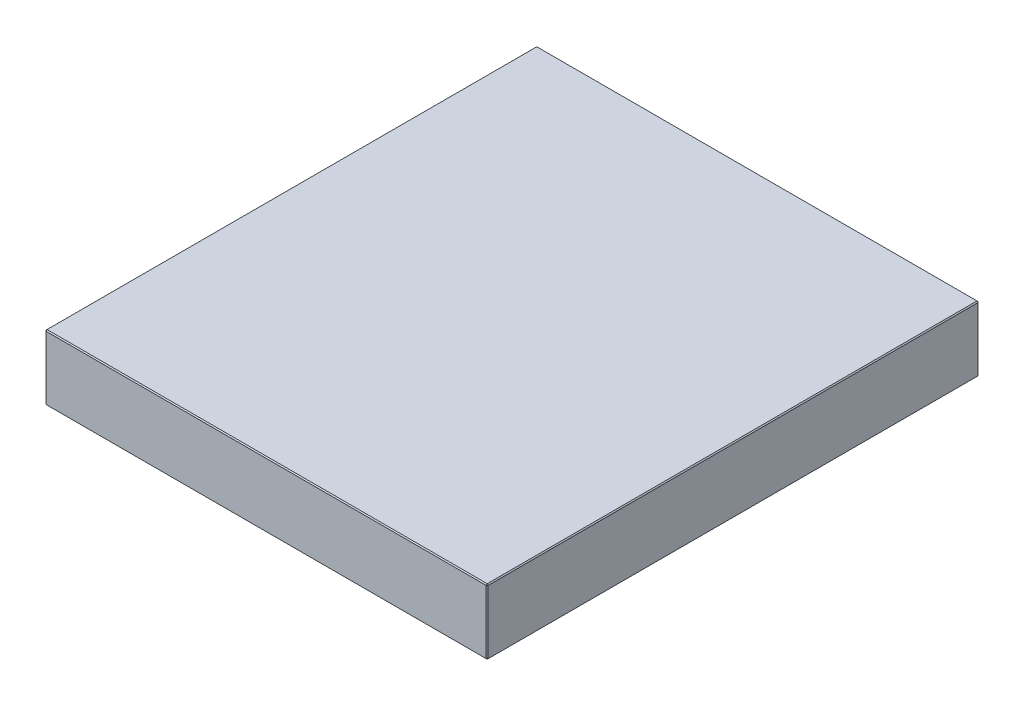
ISO-10303-21;
HEADER;
FILE_DESCRIPTION(('STEP AP214'),'2;1');
FILE_NAME('part.step','',(''),(''),'','','');
FILE_SCHEMA(('AUTOMOTIVE_DESIGN { 1 0 10303 214 1 1 1 1 }'));
ENDSEC;
DATA;
#1=APPLICATION_CONTEXT('core data for automotive mechanical design processes');
#2=APPLICATION_PROTOCOL_DEFINITION('international standard','automotive_design',2000,#1);
#3=PRODUCT_CONTEXT('',#1,'mechanical');
#4=PRODUCT('Part','Part','',(#3));
#5=PRODUCT_RELATED_PRODUCT_CATEGORY('part','',(#4));
#6=PRODUCT_DEFINITION_FORMATION('','',#4);
#7=PRODUCT_DEFINITION_CONTEXT('part definition',#1,'design');
#8=PRODUCT_DEFINITION('design','',#6,#7);
#9=PRODUCT_DEFINITION_SHAPE('','',#8);
#10=(LENGTH_UNIT() NAMED_UNIT(*) SI_UNIT(.MILLI.,.METRE.));
#11=(NAMED_UNIT(*) PLANE_ANGLE_UNIT() SI_UNIT($,.RADIAN.));
#12=(NAMED_UNIT(*) SI_UNIT($,.STERADIAN.) SOLID_ANGLE_UNIT());
#13=UNCERTAINTY_MEASURE_WITH_UNIT(LENGTH_MEASURE(1.E-05),#10,'distance_accuracy_value','');
#14=(GEOMETRIC_REPRESENTATION_CONTEXT(3) GLOBAL_UNCERTAINTY_ASSIGNED_CONTEXT((#13)) GLOBAL_UNIT_ASSIGNED_CONTEXT((#10,
#11,#12)) REPRESENTATION_CONTEXT('',''));
#15=CARTESIAN_POINT('',(0.,0.,0.));
#16=DIRECTION('',(0.,0.,1.));
#17=DIRECTION('',(1.,0.,0.));
#18=AXIS2_PLACEMENT_3D('',#15,#16,#17);
#19=CARTESIAN_POINT('',(-223.,66.,248.));
#20=DIRECTION('',(1.,0.,0.));
#21=DIRECTION('',(0.,0.,-1.));
#22=AXIS2_PLACEMENT_3D('',#19,#20,#21);
#23=PLANE('',#22);
#24=DIRECTION('',(0.,-1.,0.));
#25=VECTOR('',#24,1.);
#26=CARTESIAN_POINT('',(-223.,66.,-247.));
#27=LINE('',#26,#25);
#28=CARTESIAN_POINT('',(-223.,65.,-247.));
#29=VERTEX_POINT('',#28);
#30=CARTESIAN_POINT('',(-223.,0.999999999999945,-247.));
#31=VERTEX_POINT('',#30);
#32=EDGE_CURVE('E114',#29,#31,#27,.T.);
#33=ORIENTED_EDGE('',*,*,#32,.T.);
#34=DIRECTION('',(0.,0.,1.));
#35=VECTOR('',#34,1.);
#36=CARTESIAN_POINT('',(-223.,0.999999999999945,248.));
#37=LINE('',#36,#35);
#38=CARTESIAN_POINT('',(-223.,0.999999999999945,247.));
#39=VERTEX_POINT('',#38);
#40=EDGE_CURVE('E110',#31,#39,#37,.T.);
#41=ORIENTED_EDGE('',*,*,#40,.T.);
#42=DIRECTION('',(0.,1.,0.));
#43=VECTOR('',#42,1.);
#44=CARTESIAN_POINT('',(-223.,66.,247.));
#45=LINE('',#44,#43);
#46=CARTESIAN_POINT('',(-223.,65.,247.));
#47=VERTEX_POINT('',#46);
#48=EDGE_CURVE('E103',#39,#47,#45,.T.);
#49=ORIENTED_EDGE('',*,*,#48,.T.);
#50=DIRECTION('',(0.,0.,-1.));
#51=VECTOR('',#50,1.);
#52=CARTESIAN_POINT('',(-223.,65.,-248.));
#53=LINE('',#52,#51);
#54=EDGE_CURVE('E107',#47,#29,#53,.T.);
#55=ORIENTED_EDGE('',*,*,#54,.T.);
#56=EDGE_LOOP('',(#33,#41,#49,#55));
#57=FACE_BOUND('',#56,.T.);
#58=ADVANCED_FACE('F15',(#57),#23,.F.);
#59=CARTESIAN_POINT('',(223.,66.,248.));
#60=DIRECTION('',(0.,0.,-1.));
#61=DIRECTION('',(-1.,0.,0.));
#62=AXIS2_PLACEMENT_3D('',#59,#60,#61);
#63=PLANE('',#62);
#64=DIRECTION('',(-1.,0.,0.));
#65=VECTOR('',#64,1.);
#66=CARTESIAN_POINT('',(-223.,65.,248.));
#67=LINE('',#66,#65);
#68=CARTESIAN_POINT('',(222.,65.,248.));
#69=VERTEX_POINT('',#68);
#70=CARTESIAN_POINT('',(-222.,65.,248.));
#71=VERTEX_POINT('',#70);
#72=EDGE_CURVE('E164',#69,#71,#67,.T.);
#73=ORIENTED_EDGE('',*,*,#72,.T.);
#74=DIRECTION('',(0.,-1.,0.));
#75=VECTOR('',#74,1.);
#76=CARTESIAN_POINT('',(-222.,66.,248.));
#77=LINE('',#76,#75);
#78=CARTESIAN_POINT('',(-222.,0.999999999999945,248.));
#79=VERTEX_POINT('',#78);
#80=EDGE_CURVE('E122',#71,#79,#77,.T.);
#81=ORIENTED_EDGE('',*,*,#80,.T.);
#82=DIRECTION('',(1.,0.,0.));
#83=VECTOR('',#82,1.);
#84=CARTESIAN_POINT('',(223.,0.999999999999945,248.));
#85=LINE('',#84,#83);
#86=CARTESIAN_POINT('',(222.,0.999999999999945,248.));
#87=VERTEX_POINT('',#86);
#88=EDGE_CURVE('E168',#79,#87,#85,.T.);
#89=ORIENTED_EDGE('',*,*,#88,.T.);
#90=DIRECTION('',(0.,1.,0.));
#91=VECTOR('',#90,1.);
#92=CARTESIAN_POINT('',(222.,66.,248.));
#93=LINE('',#92,#91);
#94=EDGE_CURVE('E166',#87,#69,#93,.T.);
#95=ORIENTED_EDGE('',*,*,#94,.T.);
#96=EDGE_LOOP('',(#73,#81,#89,#95));
#97=FACE_BOUND('',#96,.T.);
#98=ADVANCED_FACE('F275',(#97),#63,.F.);
#99=CARTESIAN_POINT('',(223.,66.,248.));
#100=DIRECTION('',(-1.,0.,0.));
#101=DIRECTION('',(0.,0.,1.));
#102=AXIS2_PLACEMENT_3D('',#99,#100,#101);
#103=PLANE('',#102);
#104=DIRECTION('',(0.,0.,-1.));
#105=VECTOR('',#104,1.);
#106=CARTESIAN_POINT('',(223.,0.999999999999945,248.));
#107=LINE('',#106,#105);
#108=CARTESIAN_POINT('',(223.,0.999999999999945,247.));
#109=VERTEX_POINT('',#108);
#110=CARTESIAN_POINT('',(223.,0.999999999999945,-247.));
#111=VERTEX_POINT('',#110);
#112=EDGE_CURVE('E159',#109,#111,#107,.T.);
#113=ORIENTED_EDGE('',*,*,#112,.T.);
#114=DIRECTION('',(0.,1.,0.));
#115=VECTOR('',#114,1.);
#116=CARTESIAN_POINT('',(223.,66.,-247.));
#117=LINE('',#116,#115);
#118=CARTESIAN_POINT('',(223.,65.,-247.));
#119=VERTEX_POINT('',#118);
#120=EDGE_CURVE('E161',#111,#119,#117,.T.);
#121=ORIENTED_EDGE('',*,*,#120,.T.);
#122=DIRECTION('',(0.,0.,1.));
#123=VECTOR('',#122,1.);
#124=CARTESIAN_POINT('',(223.,65.,248.));
#125=LINE('',#124,#123);
#126=CARTESIAN_POINT('',(223.,65.,247.));
#127=VERTEX_POINT('',#126);
#128=EDGE_CURVE('E155',#119,#127,#125,.T.);
#129=ORIENTED_EDGE('',*,*,#128,.T.);
#130=DIRECTION('',(0.,-1.,0.));
#131=VECTOR('',#130,1.);
#132=CARTESIAN_POINT('',(223.,66.,247.));
#133=LINE('',#132,#131);
#134=EDGE_CURVE('E157',#127,#109,#133,.T.);
#135=ORIENTED_EDGE('',*,*,#134,.T.);
#136=EDGE_LOOP('',(#113,#121,#129,#135));
#137=FACE_BOUND('',#136,.T.);
#138=ADVANCED_FACE('F254',(#137),#103,.F.);
#139=CARTESIAN_POINT('',(223.,66.,-248.));
#140=DIRECTION('',(0.,0.,1.));
#141=DIRECTION('',(1.,0.,0.));
#142=AXIS2_PLACEMENT_3D('',#139,#140,#141);
#143=PLANE('',#142);
#144=DIRECTION('',(0.,-1.,0.));
#145=VECTOR('',#144,1.);
#146=CARTESIAN_POINT('',(222.,66.,-248.));
#147=LINE('',#146,#145);
#148=CARTESIAN_POINT('',(222.,65.,-248.));
#149=VERTEX_POINT('',#148);
#150=CARTESIAN_POINT('',(222.,0.999999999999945,-248.));
#151=VERTEX_POINT('',#150);
#152=EDGE_CURVE('E148',#149,#151,#147,.T.);
#153=ORIENTED_EDGE('',*,*,#152,.T.);
#154=DIRECTION('',(-1.,0.,0.));
#155=VECTOR('',#154,1.);
#156=CARTESIAN_POINT('',(223.,0.999999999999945,-248.));
#157=LINE('',#156,#155);
#158=CARTESIAN_POINT('',(-222.,0.999999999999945,-248.));
#159=VERTEX_POINT('',#158);
#160=EDGE_CURVE('E153',#151,#159,#157,.T.);
#161=ORIENTED_EDGE('',*,*,#160,.T.);
#162=DIRECTION('',(0.,1.,0.));
#163=VECTOR('',#162,1.);
#164=CARTESIAN_POINT('',(-222.,66.,-248.));
#165=LINE('',#164,#163);
#166=CARTESIAN_POINT('',(-222.,65.,-248.));
#167=VERTEX_POINT('',#166);
#168=EDGE_CURVE('E150',#159,#167,#165,.T.);
#169=ORIENTED_EDGE('',*,*,#168,.T.);
#170=DIRECTION('',(1.,0.,0.));
#171=VECTOR('',#170,1.);
#172=CARTESIAN_POINT('',(223.,65.,-248.));
#173=LINE('',#172,#171);
#174=EDGE_CURVE('E146',#167,#149,#173,.T.);
#175=ORIENTED_EDGE('',*,*,#174,.T.);
#176=EDGE_LOOP('',(#153,#161,#169,#175));
#177=FACE_BOUND('',#176,.T.);
#178=ADVANCED_FACE('F284',(#177),#143,.F.);
#179=CARTESIAN_POINT('',(0.,66.,0.));
#180=DIRECTION('',(0.,1.,0.));
#181=DIRECTION('',(0.,0.,1.));
#182=AXIS2_PLACEMENT_3D('',#179,#180,#181);
#183=PLANE('',#182);
#184=DIRECTION('',(0.,0.,-1.));
#185=VECTOR('',#184,1.);
#186=CARTESIAN_POINT('',(222.,66.,-248.));
#187=LINE('',#186,#185);
#188=CARTESIAN_POINT('',(222.,66.,247.));
#189=VERTEX_POINT('',#188);
#190=CARTESIAN_POINT('',(222.,66.,-247.));
#191=VERTEX_POINT('',#190);
#192=EDGE_CURVE('E24',#189,#191,#187,.T.);
#193=ORIENTED_EDGE('',*,*,#192,.T.);
#194=DIRECTION('',(-1.,0.,0.));
#195=VECTOR('',#194,1.);
#196=CARTESIAN_POINT('',(-223.,66.,-247.));
#197=LINE('',#196,#195);
#198=CARTESIAN_POINT('',(-222.,66.,-247.));
#199=VERTEX_POINT('',#198);
#200=EDGE_CURVE('E9',#191,#199,#197,.T.);
#201=ORIENTED_EDGE('',*,*,#200,.T.);
#202=DIRECTION('',(0.,0.,1.));
#203=VECTOR('',#202,1.);
#204=CARTESIAN_POINT('',(-222.,66.,248.));
#205=LINE('',#204,#203);
#206=CARTESIAN_POINT('',(-222.,66.,247.));
#207=VERTEX_POINT('',#206);
#208=EDGE_CURVE('E180',#199,#207,#205,.T.);
#209=ORIENTED_EDGE('',*,*,#208,.T.);
#210=DIRECTION('',(1.,0.,0.));
#211=VECTOR('',#210,1.);
#212=CARTESIAN_POINT('',(223.,66.,247.));
#213=LINE('',#212,#211);
#214=EDGE_CURVE('E35',#207,#189,#213,.T.);
#215=ORIENTED_EDGE('',*,*,#214,.T.);
#216=EDGE_LOOP('',(#193,#201,#209,#215));
#217=FACE_BOUND('',#216,.T.);
#218=ADVANCED_FACE('F350',(#217),#183,.T.);
#219=CARTESIAN_POINT('',(0.,0.,0.));
#220=DIRECTION('',(0.,1.,0.));
#221=DIRECTION('',(0.,0.,1.));
#222=AXIS2_PLACEMENT_3D('',#219,#220,#221);
#223=PLANE('',#222);
#224=DIRECTION('',(0.,0.,1.));
#225=VECTOR('',#224,1.);
#226=CARTESIAN_POINT('',(222.,0.,0.));
#227=LINE('',#226,#225);
#228=CARTESIAN_POINT('',(222.,0.,-247.));
#229=VERTEX_POINT('',#228);
#230=CARTESIAN_POINT('',(222.,0.,247.));
#231=VERTEX_POINT('',#230);
#232=EDGE_CURVE('E171',#229,#231,#227,.T.);
#233=ORIENTED_EDGE('',*,*,#232,.T.);
#234=DIRECTION('',(-1.,0.,0.));
#235=VECTOR('',#234,1.);
#236=CARTESIAN_POINT('',(0.,0.,247.));
#237=LINE('',#236,#235);
#238=CARTESIAN_POINT('',(-222.,0.,247.));
#239=VERTEX_POINT('',#238);
#240=EDGE_CURVE('E177',#231,#239,#237,.T.);
#241=ORIENTED_EDGE('',*,*,#240,.T.);
#242=DIRECTION('',(0.,0.,-1.));
#243=VECTOR('',#242,1.);
#244=CARTESIAN_POINT('',(-222.,0.,0.));
#245=LINE('',#244,#243);
#246=CARTESIAN_POINT('',(-222.,0.,-247.));
#247=VERTEX_POINT('',#246);
#248=EDGE_CURVE('E175',#239,#247,#245,.T.);
#249=ORIENTED_EDGE('',*,*,#248,.T.);
#250=DIRECTION('',(1.,0.,0.));
#251=VECTOR('',#250,1.);
#252=CARTESIAN_POINT('',(0.,0.,-247.));
#253=LINE('',#252,#251);
#254=EDGE_CURVE('E173',#247,#229,#253,.T.);
#255=ORIENTED_EDGE('',*,*,#254,.T.);
#256=EDGE_LOOP('',(#233,#241,#249,#255));
#257=FACE_BOUND('',#256,.T.);
#258=ADVANCED_FACE('F246',(#257),#223,.F.);
#259=CARTESIAN_POINT('',(223.,66.,247.));
#260=DIRECTION('',(-0.707106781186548,0.,-0.707106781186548));
#261=DIRECTION('',(0.,-1.,0.));
#262=AXIS2_PLACEMENT_3D('',#259,#260,#261);
#263=PLANE('',#262);
#264=DIRECTION('',(-0.707106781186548,0.,0.707106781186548));
#265=VECTOR('',#264,1.);
#266=CARTESIAN_POINT('',(222.,65.,248.));
#267=LINE('',#266,#265);
#268=EDGE_CURVE('E19',#69,#127,#267,.F.);
#269=ORIENTED_EDGE('',*,*,#268,.F.);
#270=ORIENTED_EDGE('',*,*,#94,.F.);
#271=DIRECTION('',(0.707106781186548,0.,-0.707106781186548));
#272=VECTOR('',#271,1.);
#273=CARTESIAN_POINT('',(222.,0.999999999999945,248.));
#274=LINE('',#273,#272);
#275=EDGE_CURVE('E142',#109,#87,#274,.F.);
#276=ORIENTED_EDGE('',*,*,#275,.F.);
#277=ORIENTED_EDGE('',*,*,#134,.F.);
#278=EDGE_LOOP('',(#269,#270,#276,#277));
#279=FACE_BOUND('',#278,.T.);
#280=ADVANCED_FACE('F17',(#279),#263,.F.);
#281=CARTESIAN_POINT('',(222.,65.,248.));
#282=DIRECTION('',(0.57735026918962,0.577350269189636,0.57735026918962));
#283=DIRECTION('',(0.,-0.707106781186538,0.707106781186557));
#284=AXIS2_PLACEMENT_3D('',#281,#282,#283);
#285=PLANE('',#284);
#286=DIRECTION('',(0.,-0.707106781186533,0.707106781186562));
#287=VECTOR('',#286,1.);
#288=CARTESIAN_POINT('',(222.,65.,248.));
#289=LINE('',#288,#287);
#290=EDGE_CURVE('E226',#69,#189,#289,.F.);
#291=ORIENTED_EDGE('',*,*,#290,.F.);
#292=ORIENTED_EDGE('',*,*,#268,.T.);
#293=DIRECTION('',(-0.707106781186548,0.707106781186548,0.));
#294=VECTOR('',#293,1.);
#295=CARTESIAN_POINT('',(222.5,65.5,247.));
#296=LINE('',#295,#294);
#297=EDGE_CURVE('E228',#189,#127,#296,.F.);
#298=ORIENTED_EDGE('',*,*,#297,.F.);
#299=EDGE_LOOP('',(#291,#292,#298));
#300=FACE_BOUND('',#299,.T.);
#301=ADVANCED_FACE('F270',(#300),#285,.T.);
#302=CARTESIAN_POINT('',(222.,0.999999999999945,248.));
#303=DIRECTION('',(0.57735026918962,-0.577350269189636,0.57735026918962));
#304=DIRECTION('',(0.,-0.707106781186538,-0.707106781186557));
#305=AXIS2_PLACEMENT_3D('',#302,#303,#304);
#306=PLANE('',#305);
#307=DIRECTION('',(-0.707106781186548,-0.707106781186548,0.));
#308=VECTOR('',#307,1.);
#309=CARTESIAN_POINT('',(222.5,0.499999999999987,247.));
#310=LINE('',#309,#308);
#311=EDGE_CURVE('E220',#109,#231,#310,.T.);
#312=ORIENTED_EDGE('',*,*,#311,.F.);
#313=ORIENTED_EDGE('',*,*,#275,.T.);
#314=DIRECTION('',(0.,0.707106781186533,0.707106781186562));
#315=VECTOR('',#314,1.);
#316=CARTESIAN_POINT('',(222.,0.999999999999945,248.));
#317=LINE('',#316,#315);
#318=EDGE_CURVE('E223',#231,#87,#317,.T.);
#319=ORIENTED_EDGE('',*,*,#318,.F.);
#320=EDGE_LOOP('',(#312,#313,#319));
#321=FACE_BOUND('',#320,.T.);
#322=ADVANCED_FACE('F235',(#321),#306,.T.);
#323=CARTESIAN_POINT('',(222.,66.,0.));
#324=DIRECTION('',(0.707106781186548,0.707106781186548,0.));
#325=DIRECTION('',(0.,0.,1.));
#326=AXIS2_PLACEMENT_3D('',#323,#324,#325);
#327=PLANE('',#326);
#328=ORIENTED_EDGE('',*,*,#297,.T.);
#329=ORIENTED_EDGE('',*,*,#128,.F.);
#330=DIRECTION('',(0.707106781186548,-0.707106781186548,0.));
#331=VECTOR('',#330,1.);
#332=CARTESIAN_POINT('',(223.,65.,-247.));
#333=LINE('',#332,#331);
#334=EDGE_CURVE('E215',#191,#119,#333,.T.);
#335=ORIENTED_EDGE('',*,*,#334,.F.);
#336=ORIENTED_EDGE('',*,*,#192,.F.);
#337=EDGE_LOOP('',(#328,#329,#335,#336));
#338=FACE_BOUND('',#337,.T.);
#339=ADVANCED_FACE('F265',(#338),#327,.T.);
#340=CARTESIAN_POINT('',(0.,66.,247.));
#341=DIRECTION('',(0.,0.707106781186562,0.707106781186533));
#342=DIRECTION('',(-1.,0.,0.));
#343=AXIS2_PLACEMENT_3D('',#340,#341,#342);
#344=PLANE('',#343);
#345=ORIENTED_EDGE('',*,*,#290,.T.);
#346=ORIENTED_EDGE('',*,*,#214,.F.);
#347=DIRECTION('',(0.,0.707106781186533,-0.707106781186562));
#348=VECTOR('',#347,1.);
#349=CARTESIAN_POINT('',(-222.,65.5,247.5));
#350=LINE('',#349,#348);
#351=EDGE_CURVE('E126',#71,#207,#350,.T.);
#352=ORIENTED_EDGE('',*,*,#351,.F.);
#353=ORIENTED_EDGE('',*,*,#72,.F.);
#354=EDGE_LOOP('',(#345,#346,#352,#353));
#355=FACE_BOUND('',#354,.T.);
#356=ADVANCED_FACE('F273',(#355),#344,.T.);
#357=CARTESIAN_POINT('',(-222.,66.,248.));
#358=DIRECTION('',(0.707106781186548,0.,-0.707106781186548));
#359=DIRECTION('',(0.,-1.,0.));
#360=AXIS2_PLACEMENT_3D('',#357,#358,#359);
#361=PLANE('',#360);
#362=DIRECTION('',(0.707106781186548,0.,0.707106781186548));
#363=VECTOR('',#362,1.);
#364=CARTESIAN_POINT('',(-222.,0.999999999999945,248.));
#365=LINE('',#364,#363);
#366=EDGE_CURVE('E127',#79,#39,#365,.F.);
#367=ORIENTED_EDGE('',*,*,#366,.F.);
#368=ORIENTED_EDGE('',*,*,#80,.F.);
#369=DIRECTION('',(-0.707106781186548,0.,-0.707106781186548));
#370=VECTOR('',#369,1.);
#371=CARTESIAN_POINT('',(-223.,65.,247.));
#372=LINE('',#371,#370);
#373=EDGE_CURVE('E118',#47,#71,#372,.F.);
#374=ORIENTED_EDGE('',*,*,#373,.F.);
#375=ORIENTED_EDGE('',*,*,#48,.F.);
#376=EDGE_LOOP('',(#367,#368,#374,#375));
#377=FACE_BOUND('',#376,.T.);
#378=ADVANCED_FACE('F120',(#377),#361,.F.);
#379=CARTESIAN_POINT('',(223.,0.999999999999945,248.));
#380=DIRECTION('',(0.,0.707106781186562,-0.707106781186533));
#381=DIRECTION('',(1.,0.,0.));
#382=AXIS2_PLACEMENT_3D('',#379,#380,#381);
#383=PLANE('',#382);
#384=ORIENTED_EDGE('',*,*,#318,.T.);
#385=ORIENTED_EDGE('',*,*,#88,.F.);
#386=DIRECTION('',(0.,-0.707106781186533,-0.707106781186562));
#387=VECTOR('',#386,1.);
#388=CARTESIAN_POINT('',(-222.,0.999999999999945,248.));
#389=LINE('',#388,#387);
#390=EDGE_CURVE('E211',#239,#79,#389,.F.);
#391=ORIENTED_EDGE('',*,*,#390,.F.);
#392=ORIENTED_EDGE('',*,*,#240,.F.);
#393=EDGE_LOOP('',(#384,#385,#391,#392));
#394=FACE_BOUND('',#393,.T.);
#395=ADVANCED_FACE('F243',(#394),#383,.F.);
#396=CARTESIAN_POINT('',(223.,0.999999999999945,248.));
#397=DIRECTION('',(-0.707106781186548,0.707106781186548,0.));
#398=DIRECTION('',(0.,0.,-1.));
#399=AXIS2_PLACEMENT_3D('',#396,#397,#398);
#400=PLANE('',#399);
#401=ORIENTED_EDGE('',*,*,#311,.T.);
#402=ORIENTED_EDGE('',*,*,#232,.F.);
#403=DIRECTION('',(0.707106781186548,0.707106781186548,0.));
#404=VECTOR('',#403,1.);
#405=CARTESIAN_POINT('',(222.5,0.499999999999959,-247.));
#406=LINE('',#405,#404);
#407=EDGE_CURVE('E208',#111,#229,#406,.F.);
#408=ORIENTED_EDGE('',*,*,#407,.F.);
#409=ORIENTED_EDGE('',*,*,#112,.F.);
#410=EDGE_LOOP('',(#401,#402,#408,#409));
#411=FACE_BOUND('',#410,.T.);
#412=ADVANCED_FACE('F251',(#411),#400,.F.);
#413=CARTESIAN_POINT('',(222.,66.,-248.));
#414=DIRECTION('',(-0.707106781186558,0.,0.707106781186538));
#415=DIRECTION('',(0.,-1.,0.));
#416=AXIS2_PLACEMENT_3D('',#413,#414,#415);
#417=PLANE('',#416);
#418=DIRECTION('',(0.707106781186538,0.,0.707106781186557));
#419=VECTOR('',#418,1.);
#420=CARTESIAN_POINT('',(223.,65.,-247.));
#421=LINE('',#420,#419);
#422=EDGE_CURVE('E217',#119,#149,#421,.F.);
#423=ORIENTED_EDGE('',*,*,#422,.F.);
#424=ORIENTED_EDGE('',*,*,#120,.F.);
#425=DIRECTION('',(-0.707106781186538,0.,-0.707106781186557));
#426=VECTOR('',#425,1.);
#427=CARTESIAN_POINT('',(222.,0.999999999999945,-248.));
#428=LINE('',#427,#426);
#429=EDGE_CURVE('E205',#151,#111,#428,.F.);
#430=ORIENTED_EDGE('',*,*,#429,.F.);
#431=ORIENTED_EDGE('',*,*,#152,.F.);
#432=EDGE_LOOP('',(#423,#424,#430,#431));
#433=FACE_BOUND('',#432,.T.);
#434=ADVANCED_FACE('F258',(#433),#417,.F.);
#435=CARTESIAN_POINT('',(223.,65.,-247.));
#436=DIRECTION('',(0.577350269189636,0.57735026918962,-0.57735026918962));
#437=DIRECTION('',(-0.707106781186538,0.,-0.707106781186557));
#438=AXIS2_PLACEMENT_3D('',#435,#436,#437);
#439=PLANE('',#438);
#440=ORIENTED_EDGE('',*,*,#334,.T.);
#441=ORIENTED_EDGE('',*,*,#422,.T.);
#442=DIRECTION('',(0.,0.707106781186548,0.707106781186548));
#443=VECTOR('',#442,1.);
#444=CARTESIAN_POINT('',(222.,65.5,-247.5));
#445=LINE('',#444,#443);
#446=EDGE_CURVE('E134',#191,#149,#445,.F.);
#447=ORIENTED_EDGE('',*,*,#446,.F.);
#448=EDGE_LOOP('',(#440,#441,#447));
#449=FACE_BOUND('',#448,.T.);
#450=ADVANCED_FACE('F325',(#449),#439,.T.);
#451=CARTESIAN_POINT('',(-223.,65.,247.));
#452=DIRECTION('',(-0.57735026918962,0.577350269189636,0.57735026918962));
#453=DIRECTION('',(0.,-0.707106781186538,0.707106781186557));
#454=AXIS2_PLACEMENT_3D('',#451,#452,#453);
#455=PLANE('',#454);
#456=ORIENTED_EDGE('',*,*,#373,.T.);
#457=ORIENTED_EDGE('',*,*,#351,.T.);
#458=DIRECTION('',(-0.707106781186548,-0.707106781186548,0.));
#459=VECTOR('',#458,1.);
#460=CARTESIAN_POINT('',(-223.,65.,247.));
#461=LINE('',#460,#459);
#462=EDGE_CURVE('E130',#47,#207,#461,.F.);
#463=ORIENTED_EDGE('',*,*,#462,.F.);
#464=EDGE_LOOP('',(#456,#457,#463));
#465=FACE_BOUND('',#464,.T.);
#466=ADVANCED_FACE('F131',(#465),#455,.T.);
#467=CARTESIAN_POINT('',(-222.,0.999999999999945,248.));
#468=DIRECTION('',(-0.57735026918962,-0.577350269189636,0.57735026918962));
#469=DIRECTION('',(0.,-0.707106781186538,-0.707106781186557));
#470=AXIS2_PLACEMENT_3D('',#467,#468,#469);
#471=PLANE('',#470);
#472=ORIENTED_EDGE('',*,*,#390,.T.);
#473=ORIENTED_EDGE('',*,*,#366,.T.);
#474=DIRECTION('',(-0.707106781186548,0.707106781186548,0.));
#475=VECTOR('',#474,1.);
#476=CARTESIAN_POINT('',(-222.5,0.499999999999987,247.));
#477=LINE('',#476,#475);
#478=EDGE_CURVE('E135',#239,#39,#477,.T.);
#479=ORIENTED_EDGE('',*,*,#478,.F.);
#480=EDGE_LOOP('',(#472,#473,#479));
#481=FACE_BOUND('',#480,.T.);
#482=ADVANCED_FACE('F318',(#481),#471,.T.);
#483=CARTESIAN_POINT('',(222.,0.999999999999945,-248.));
#484=DIRECTION('',(0.577350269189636,-0.57735026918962,-0.57735026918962));
#485=DIRECTION('',(-0.707106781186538,0.,-0.707106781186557));
#486=AXIS2_PLACEMENT_3D('',#483,#484,#485);
#487=PLANE('',#486);
#488=ORIENTED_EDGE('',*,*,#429,.T.);
#489=ORIENTED_EDGE('',*,*,#407,.T.);
#490=DIRECTION('',(0.,-0.707106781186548,0.707106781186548));
#491=VECTOR('',#490,1.);
#492=CARTESIAN_POINT('',(222.,0.999999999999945,-248.));
#493=LINE('',#492,#491);
#494=EDGE_CURVE('E198',#151,#229,#493,.T.);
#495=ORIENTED_EDGE('',*,*,#494,.F.);
#496=EDGE_LOOP('',(#488,#489,#495));
#497=FACE_BOUND('',#496,.T.);
#498=ADVANCED_FACE('F314',(#497),#487,.T.);
#499=CARTESIAN_POINT('',(0.,66.,-247.));
#500=DIRECTION('',(0.,0.707106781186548,-0.707106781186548));
#501=DIRECTION('',(1.,0.,0.));
#502=AXIS2_PLACEMENT_3D('',#499,#500,#501);
#503=PLANE('',#502);
#504=ORIENTED_EDGE('',*,*,#446,.T.);
#505=ORIENTED_EDGE('',*,*,#174,.F.);
#506=DIRECTION('',(0.,-0.707106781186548,-0.707106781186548));
#507=VECTOR('',#506,1.);
#508=CARTESIAN_POINT('',(-222.,65.,-248.));
#509=LINE('',#508,#507);
#510=EDGE_CURVE('E195',#199,#167,#509,.T.);
#511=ORIENTED_EDGE('',*,*,#510,.F.);
#512=ORIENTED_EDGE('',*,*,#200,.F.);
#513=EDGE_LOOP('',(#504,#505,#511,#512));
#514=FACE_BOUND('',#513,.T.);
#515=ADVANCED_FACE('F311',(#514),#503,.T.);
#516=CARTESIAN_POINT('',(-222.,66.,0.));
#517=DIRECTION('',(-0.707106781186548,0.707106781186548,0.));
#518=DIRECTION('',(0.,0.,-1.));
#519=AXIS2_PLACEMENT_3D('',#516,#517,#518);
#520=PLANE('',#519);
#521=ORIENTED_EDGE('',*,*,#462,.T.);
#522=ORIENTED_EDGE('',*,*,#208,.F.);
#523=DIRECTION('',(0.707106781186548,0.707106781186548,0.));
#524=VECTOR('',#523,1.);
#525=CARTESIAN_POINT('',(-222.5,65.5,-247.));
#526=LINE('',#525,#524);
#527=EDGE_CURVE('E138',#29,#199,#526,.T.);
#528=ORIENTED_EDGE('',*,*,#527,.F.);
#529=ORIENTED_EDGE('',*,*,#54,.F.);
#530=EDGE_LOOP('',(#521,#522,#528,#529));
#531=FACE_BOUND('',#530,.T.);
#532=ADVANCED_FACE('F137',(#531),#520,.T.);
#533=CARTESIAN_POINT('',(-223.,0.999999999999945,248.));
#534=DIRECTION('',(0.707106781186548,0.707106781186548,0.));
#535=DIRECTION('',(0.,0.,1.));
#536=AXIS2_PLACEMENT_3D('',#533,#534,#535);
#537=PLANE('',#536);
#538=ORIENTED_EDGE('',*,*,#478,.T.);
#539=ORIENTED_EDGE('',*,*,#40,.F.);
#540=DIRECTION('',(0.707106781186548,-0.707106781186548,0.));
#541=VECTOR('',#540,1.);
#542=CARTESIAN_POINT('',(-223.,0.999999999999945,-247.));
#543=LINE('',#542,#541);
#544=EDGE_CURVE('E191',#247,#31,#543,.F.);
#545=ORIENTED_EDGE('',*,*,#544,.F.);
#546=ORIENTED_EDGE('',*,*,#248,.F.);
#547=EDGE_LOOP('',(#538,#539,#545,#546));
#548=FACE_BOUND('',#547,.T.);
#549=ADVANCED_FACE('F304',(#548),#537,.F.);
#550=CARTESIAN_POINT('',(223.,0.999999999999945,-248.));
#551=DIRECTION('',(0.,0.707106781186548,0.707106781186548));
#552=DIRECTION('',(-1.,0.,0.));
#553=AXIS2_PLACEMENT_3D('',#550,#551,#552);
#554=PLANE('',#553);
#555=ORIENTED_EDGE('',*,*,#494,.T.);
#556=ORIENTED_EDGE('',*,*,#254,.F.);
#557=DIRECTION('',(0.,0.707106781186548,-0.707106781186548));
#558=VECTOR('',#557,1.);
#559=CARTESIAN_POINT('',(-222.,0.499999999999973,-247.5));
#560=LINE('',#559,#558);
#561=EDGE_CURVE('E188',#159,#247,#560,.F.);
#562=ORIENTED_EDGE('',*,*,#561,.F.);
#563=ORIENTED_EDGE('',*,*,#160,.F.);
#564=EDGE_LOOP('',(#555,#556,#562,#563));
#565=FACE_BOUND('',#564,.T.);
#566=ADVANCED_FACE('F300',(#565),#554,.F.);
#567=CARTESIAN_POINT('',(-222.,65.,-248.));
#568=DIRECTION('',(-0.577350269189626,0.577350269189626,-0.577350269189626));
#569=DIRECTION('',(-0.707106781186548,0.,0.707106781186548));
#570=AXIS2_PLACEMENT_3D('',#567,#568,#569);
#571=PLANE('',#570);
#572=ORIENTED_EDGE('',*,*,#527,.T.);
#573=ORIENTED_EDGE('',*,*,#510,.T.);
#574=DIRECTION('',(0.707106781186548,0.,-0.707106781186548));
#575=VECTOR('',#574,1.);
#576=CARTESIAN_POINT('',(-222.,65.,-248.));
#577=LINE('',#576,#575);
#578=EDGE_CURVE('E186',#29,#167,#577,.T.);
#579=ORIENTED_EDGE('',*,*,#578,.F.);
#580=EDGE_LOOP('',(#572,#573,#579));
#581=FACE_BOUND('',#580,.T.);
#582=ADVANCED_FACE('F296',(#581),#571,.T.);
#583=CARTESIAN_POINT('',(-223.,0.999999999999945,-247.));
#584=DIRECTION('',(-0.577350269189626,-0.577350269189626,-0.577350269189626));
#585=DIRECTION('',(-0.707106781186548,0.,0.707106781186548));
#586=AXIS2_PLACEMENT_3D('',#583,#584,#585);
#587=PLANE('',#586);
#588=ORIENTED_EDGE('',*,*,#561,.T.);
#589=ORIENTED_EDGE('',*,*,#544,.T.);
#590=DIRECTION('',(-0.707106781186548,0.,0.707106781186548));
#591=VECTOR('',#590,1.);
#592=CARTESIAN_POINT('',(-223.,0.999999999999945,-247.));
#593=LINE('',#592,#591);
#594=EDGE_CURVE('E184',#159,#31,#593,.T.);
#595=ORIENTED_EDGE('',*,*,#594,.F.);
#596=EDGE_LOOP('',(#588,#589,#595));
#597=FACE_BOUND('',#596,.T.);
#598=ADVANCED_FACE('F292',(#597),#587,.T.);
#599=CARTESIAN_POINT('',(-223.,66.,-247.));
#600=DIRECTION('',(0.707106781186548,0.,0.707106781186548));
#601=DIRECTION('',(0.,-1.,0.));
#602=AXIS2_PLACEMENT_3D('',#599,#600,#601);
#603=PLANE('',#602);
#604=ORIENTED_EDGE('',*,*,#578,.T.);
#605=ORIENTED_EDGE('',*,*,#168,.F.);
#606=ORIENTED_EDGE('',*,*,#594,.T.);
#607=ORIENTED_EDGE('',*,*,#32,.F.);
#608=EDGE_LOOP('',(#604,#605,#606,#607));
#609=FACE_BOUND('',#608,.T.);
#610=ADVANCED_FACE('F289',(#609),#603,.F.);
#611=CLOSED_SHELL('',(#58,#98,#138,#178,#218,#258,#280,#301,#322,#339,#356,#378,#395,#412,#434,
#450,#466,#482,#498,#515,#532,#549,#566,#582,#598,#610));
#612=MANIFOLD_SOLID_BREP('B1',#611);
#613=ADVANCED_BREP_SHAPE_REPRESENTATION('',(#18,#612),#14);
#614=SHAPE_DEFINITION_REPRESENTATION(#9,#613);
ENDSEC;
END-ISO-10303-21;
